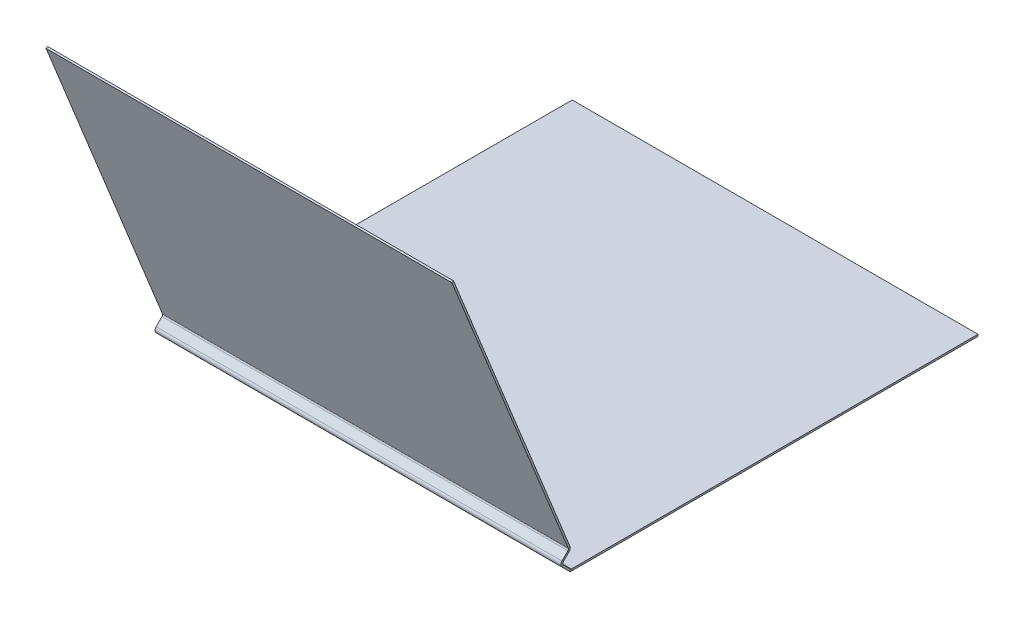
ISO-10303-21;
HEADER;
FILE_DESCRIPTION(('STEP AP214'),'2;1');
FILE_NAME('part.step','',(''),(''),'','','');
FILE_SCHEMA(('AUTOMOTIVE_DESIGN { 1 0 10303 214 1 1 1 1 }'));
ENDSEC;
DATA;
#1=APPLICATION_CONTEXT('core data for automotive mechanical design processes');
#2=APPLICATION_PROTOCOL_DEFINITION('international standard','automotive_design',2000,#1);
#3=PRODUCT_CONTEXT('',#1,'mechanical');
#4=PRODUCT('Part','Part','',(#3));
#5=PRODUCT_RELATED_PRODUCT_CATEGORY('part','',(#4));
#6=PRODUCT_DEFINITION_FORMATION('','',#4);
#7=PRODUCT_DEFINITION_CONTEXT('part definition',#1,'design');
#8=PRODUCT_DEFINITION('design','',#6,#7);
#9=PRODUCT_DEFINITION_SHAPE('','',#8);
#10=(LENGTH_UNIT() NAMED_UNIT(*) SI_UNIT(.MILLI.,.METRE.));
#11=(NAMED_UNIT(*) PLANE_ANGLE_UNIT() SI_UNIT($,.RADIAN.));
#12=(NAMED_UNIT(*) SI_UNIT($,.STERADIAN.) SOLID_ANGLE_UNIT());
#13=UNCERTAINTY_MEASURE_WITH_UNIT(LENGTH_MEASURE(1.E-05),#10,'distance_accuracy_value','');
#14=(GEOMETRIC_REPRESENTATION_CONTEXT(3) GLOBAL_UNCERTAINTY_ASSIGNED_CONTEXT((#13)) GLOBAL_UNIT_ASSIGNED_CONTEXT((#10,
#11,#12)) REPRESENTATION_CONTEXT('',''));
#15=CARTESIAN_POINT('',(0.,0.,0.));
#16=DIRECTION('',(0.,0.,1.));
#17=DIRECTION('',(1.,0.,0.));
#18=AXIS2_PLACEMENT_3D('',#15,#16,#17);
#19=CARTESIAN_POINT('',(0.,32.8730244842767,676.402));
#20=DIRECTION('',(-1.,0.,0.));
#21=DIRECTION('',(0.,-1.,0.));
#22=AXIS2_PLACEMENT_3D('',#19,#20,#21);
#23=PLANE('',#22);
#24=DIRECTION('',(0.,0.707106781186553,-0.707106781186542));
#25=VECTOR('',#24,1.);
#26=CARTESIAN_POINT('',(0.,32.8730244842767,676.402));
#27=LINE('',#26,#25);
#28=CARTESIAN_POINT('',(1.11022302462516E-13,19.3128377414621,689.962186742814));
#29=VERTEX_POINT('',#28);
#30=CARTESIAN_POINT('',(0.,29.0456583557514,680.229366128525));
#31=VERTEX_POINT('',#30);
#32=EDGE_CURVE('E291',#29,#31,#27,.T.);
#33=ORIENTED_EDGE('',*,*,#32,.T.);
#34=DIRECTION('',(0.,-0.707106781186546,-0.707106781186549));
#35=VECTOR('',#34,1.);
#36=CARTESIAN_POINT('',(0.,29.0456583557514,680.229366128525));
#37=LINE('',#36,#35);
#38=CARTESIAN_POINT('',(0.,26.8903968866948,678.074104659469));
#39=VERTEX_POINT('',#38);
#40=EDGE_CURVE('E279',#31,#39,#37,.T.);
#41=ORIENTED_EDGE('',*,*,#40,.T.);
#42=DIRECTION('',(0.,-0.707106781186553,0.707106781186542));
#43=VECTOR('',#42,1.);
#44=CARTESIAN_POINT('',(-2.24457559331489E-12,352.482250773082,352.482250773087));
#45=LINE('',#44,#43);
#46=CARTESIAN_POINT('',(1.11022302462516E-13,17.1575762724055,687.806925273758));
#47=VERTEX_POINT('',#46);
#48=EDGE_CURVE('E295',#47,#39,#45,.F.);
#49=ORIENTED_EDGE('',*,*,#48,.F.);
#50=DIRECTION('',(0.,0.707106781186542,0.707106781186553));
#51=VECTOR('',#50,1.);
#52=CARTESIAN_POINT('',(0.,19.3128377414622,689.962186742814));
#53=LINE('',#52,#51);
#54=EDGE_CURVE('E286',#47,#29,#53,.T.);
#55=ORIENTED_EDGE('',*,*,#54,.T.);
#56=EDGE_LOOP('',(#33,#41,#49,#55));
#57=FACE_BOUND('',#56,.T.);
#58=ADVANCED_FACE('F106',(#57),#23,.T.);
#59=CARTESIAN_POINT('',(0.,354.637512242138,354.637512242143));
#60=DIRECTION('',(0.,0.707106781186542,0.707106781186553));
#61=DIRECTION('',(0.,-0.707106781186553,0.707106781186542));
#62=AXIS2_PLACEMENT_3D('',#59,#60,#61);
#63=PLANE('',#62);
#64=DIRECTION('',(0.,-0.707106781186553,0.707106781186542));
#65=VECTOR('',#64,1.);
#66=CARTESIAN_POINT('',(673.1,17.0677737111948,692.207250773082));
#67=LINE('',#66,#65);
#68=CARTESIAN_POINT('',(673.1,29.0456583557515,680.229366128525));
#69=VERTEX_POINT('',#68);
#70=CARTESIAN_POINT('',(673.1,19.3128377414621,689.962186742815));
#71=VERTEX_POINT('',#70);
#72=EDGE_CURVE('E288',#69,#71,#67,.T.);
#73=ORIENTED_EDGE('',*,*,#72,.F.);
#74=DIRECTION('',(-1.,0.,0.));
#75=VECTOR('',#74,1.);
#76=CARTESIAN_POINT('',(0.,29.0456583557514,680.229366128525));
#77=LINE('',#76,#75);
#78=EDGE_CURVE('E130',#31,#69,#77,.F.);
#79=ORIENTED_EDGE('',*,*,#78,.F.);
#80=ORIENTED_EDGE('',*,*,#32,.F.);
#81=DIRECTION('',(1.,0.,0.));
#82=VECTOR('',#81,1.);
#83=CARTESIAN_POINT('',(-1.56316945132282E-13,19.3128377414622,689.962186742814));
#84=LINE('',#83,#82);
#85=EDGE_CURVE('E298',#29,#71,#84,.T.);
#86=ORIENTED_EDGE('',*,*,#85,.T.);
#87=EDGE_LOOP('',(#73,#79,#80,#86));
#88=FACE_BOUND('',#87,.T.);
#89=ADVANCED_FACE('F428',(#88),#63,.T.);
#90=CARTESIAN_POINT('',(0.,352.482250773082,352.482250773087));
#91=DIRECTION('',(0.,0.707106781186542,0.707106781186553));
#92=DIRECTION('',(0.,-0.707106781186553,0.707106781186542));
#93=AXIS2_PLACEMENT_3D('',#90,#91,#92);
#94=PLANE('',#93);
#95=DIRECTION('',(-1.,0.,0.));
#96=VECTOR('',#95,1.);
#97=CARTESIAN_POINT('',(0.,26.8903968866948,678.074104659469));
#98=LINE('',#97,#96);
#99=CARTESIAN_POINT('',(673.1,26.8903968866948,678.074104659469));
#100=VERTEX_POINT('',#99);
#101=EDGE_CURVE('E229',#39,#100,#98,.F.);
#102=ORIENTED_EDGE('',*,*,#101,.T.);
#103=DIRECTION('',(0.,0.707106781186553,-0.707106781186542));
#104=VECTOR('',#103,1.);
#105=CARTESIAN_POINT('',(673.099999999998,352.482250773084,352.482250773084));
#106=LINE('',#105,#104);
#107=CARTESIAN_POINT('',(673.1,17.1575762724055,687.806925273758));
#108=VERTEX_POINT('',#107);
#109=EDGE_CURVE('E293',#100,#108,#106,.F.);
#110=ORIENTED_EDGE('',*,*,#109,.T.);
#111=DIRECTION('',(-1.,0.,0.));
#112=VECTOR('',#111,1.);
#113=CARTESIAN_POINT('',(0.,17.1575762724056,687.806925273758));
#114=LINE('',#113,#112);
#115=EDGE_CURVE('E304',#47,#108,#114,.F.);
#116=ORIENTED_EDGE('',*,*,#115,.F.);
#117=ORIENTED_EDGE('',*,*,#48,.T.);
#118=EDGE_LOOP('',(#102,#110,#116,#117));
#119=FACE_BOUND('',#118,.T.);
#120=ADVANCED_FACE('F482',(#119),#94,.F.);
#121=CARTESIAN_POINT('',(673.1,14.9125122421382,694.362512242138));
#122=DIRECTION('',(-1.,0.,0.));
#123=DIRECTION('',(0.,0.,1.));
#124=AXIS2_PLACEMENT_3D('',#121,#122,#123);
#125=PLANE('',#124);
#126=DIRECTION('',(0.,-0.707106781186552,0.707106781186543));
#127=VECTOR('',#126,1.);
#128=CARTESIAN_POINT('',(673.1,12.667448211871,687.806925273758));
#129=LINE('',#128,#127);
#130=CARTESIAN_POINT('',(673.1,12.6674482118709,687.806925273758));
#131=VERTEX_POINT('',#130);
#132=CARTESIAN_POINT('',(673.1,10.5121867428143,689.962186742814));
#133=VERTEX_POINT('',#132);
#134=EDGE_CURVE('E315',#131,#133,#129,.T.);
#135=ORIENTED_EDGE('',*,*,#134,.T.);
#136=DIRECTION('',(0.,0.707106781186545,0.70710678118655));
#137=VECTOR('',#136,1.);
#138=CARTESIAN_POINT('',(673.100000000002,-341.880261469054,337.569738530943));
#139=LINE('',#138,#137);
#140=CARTESIAN_POINT('',(673.1,-1.22532549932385,678.224674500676));
#141=VERTEX_POINT('',#140);
#142=EDGE_CURVE('E335',#141,#133,#139,.T.);
#143=ORIENTED_EDGE('',*,*,#142,.F.);
#144=DIRECTION('',(0.,0.70710678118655,-0.707106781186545));
#145=VECTOR('',#144,1.);
#146=CARTESIAN_POINT('',(673.1,0.929935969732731,676.06941303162));
#147=LINE('',#146,#145);
#148=CARTESIAN_POINT('',(673.1,0.929935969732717,676.06941303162));
#149=VERTEX_POINT('',#148);
#150=EDGE_CURVE('E345',#149,#141,#147,.F.);
#151=ORIENTED_EDGE('',*,*,#150,.F.);
#152=DIRECTION('',(0.,-0.707106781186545,-0.70710678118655));
#153=VECTOR('',#152,1.);
#154=CARTESIAN_POINT('',(673.1,17.0677737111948,692.207250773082));
#155=LINE('',#154,#153);
#156=EDGE_CURVE('E339',#149,#131,#155,.F.);
#157=ORIENTED_EDGE('',*,*,#156,.T.);
#158=EDGE_LOOP('',(#135,#143,#151,#157));
#159=FACE_BOUND('',#158,.T.);
#160=ADVANCED_FACE('F502',(#159),#125,.F.);
#161=CARTESIAN_POINT('',(0.,-2.15526146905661,677.294738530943));
#162=DIRECTION('',(1.,0.,0.));
#163=DIRECTION('',(0.,0.,-1.));
#164=AXIS2_PLACEMENT_3D('',#161,#162,#163);
#165=PLANE('',#164);
#166=DIRECTION('',(0.,-0.707106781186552,0.707106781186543));
#167=VECTOR('',#166,1.);
#168=CARTESIAN_POINT('',(1.11022302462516E-13,12.667448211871,687.806925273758));
#169=LINE('',#168,#167);
#170=CARTESIAN_POINT('',(1.11022302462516E-13,12.667448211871,687.806925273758));
#171=VERTEX_POINT('',#170);
#172=CARTESIAN_POINT('',(1.11022302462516E-13,10.5121867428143,689.962186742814));
#173=VERTEX_POINT('',#172);
#174=EDGE_CURVE('E326',#171,#173,#169,.T.);
#175=ORIENTED_EDGE('',*,*,#174,.F.);
#176=DIRECTION('',(0.,0.707106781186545,0.70710678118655));
#177=VECTOR('',#176,1.);
#178=CARTESIAN_POINT('',(0.,0.,675.139477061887));
#179=LINE('',#178,#177);
#180=CARTESIAN_POINT('',(1.11022302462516E-13,0.92993596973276,676.06941303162));
#181=VERTEX_POINT('',#180);
#182=EDGE_CURVE('E337',#171,#181,#179,.F.);
#183=ORIENTED_EDGE('',*,*,#182,.T.);
#184=DIRECTION('',(0.,0.70710678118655,-0.707106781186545));
#185=VECTOR('',#184,1.);
#186=CARTESIAN_POINT('',(0.,-1.22532549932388,678.224674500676));
#187=LINE('',#186,#185);
#188=CARTESIAN_POINT('',(1.10738964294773E-13,-1.22532549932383,678.224674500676));
#189=VERTEX_POINT('',#188);
#190=EDGE_CURVE('E329',#181,#189,#187,.F.);
#191=ORIENTED_EDGE('',*,*,#190,.T.);
#192=DIRECTION('',(0.,-0.707106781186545,-0.70710678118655));
#193=VECTOR('',#192,1.);
#194=CARTESIAN_POINT('',(2.14777796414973E-13,-341.880261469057,337.569738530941));
#195=LINE('',#194,#193);
#196=EDGE_CURVE('E332',#173,#189,#195,.T.);
#197=ORIENTED_EDGE('',*,*,#196,.F.);
#198=EDGE_LOOP('',(#175,#183,#191,#197));
#199=FACE_BOUND('',#198,.T.);
#200=ADVANCED_FACE('F413',(#199),#165,.F.);
#201=CARTESIAN_POINT('',(0.,-341.880261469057,337.569738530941));
#202=DIRECTION('',(0.,0.70710678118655,-0.707106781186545));
#203=DIRECTION('',(0.,0.707106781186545,0.70710678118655));
#204=AXIS2_PLACEMENT_3D('',#201,#202,#203);
#205=PLANE('',#204);
#206=DIRECTION('',(1.,0.,0.));
#207=VECTOR('',#206,1.);
#208=CARTESIAN_POINT('',(673.1,10.5121867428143,689.962186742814));
#209=LINE('',#208,#207);
#210=EDGE_CURVE('E309',#133,#173,#209,.F.);
#211=ORIENTED_EDGE('',*,*,#210,.T.);
#212=ORIENTED_EDGE('',*,*,#196,.T.);
#213=DIRECTION('',(1.,0.,0.));
#214=VECTOR('',#213,1.);
#215=CARTESIAN_POINT('',(0.,-1.22532549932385,678.224674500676));
#216=LINE('',#215,#214);
#217=EDGE_CURVE('E342',#141,#189,#216,.F.);
#218=ORIENTED_EDGE('',*,*,#217,.F.);
#219=ORIENTED_EDGE('',*,*,#142,.T.);
#220=EDGE_LOOP('',(#211,#212,#218,#219));
#221=FACE_BOUND('',#220,.T.);
#222=ADVANCED_FACE('F494',(#221),#205,.F.);
#223=CARTESIAN_POINT('',(0.,-339.725,335.414477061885));
#224=DIRECTION('',(0.,0.70710678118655,-0.707106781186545));
#225=DIRECTION('',(0.,0.707106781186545,0.70710678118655));
#226=AXIS2_PLACEMENT_3D('',#223,#224,#225);
#227=PLANE('',#226);
#228=ORIENTED_EDGE('',*,*,#182,.F.);
#229=DIRECTION('',(1.,0.,0.));
#230=VECTOR('',#229,1.);
#231=CARTESIAN_POINT('',(673.1,12.667448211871,687.806925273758));
#232=LINE('',#231,#230);
#233=EDGE_CURVE('E321',#131,#171,#232,.F.);
#234=ORIENTED_EDGE('',*,*,#233,.F.);
#235=ORIENTED_EDGE('',*,*,#156,.F.);
#236=DIRECTION('',(1.,0.,0.));
#237=VECTOR('',#236,1.);
#238=CARTESIAN_POINT('',(0.,0.929935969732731,676.06941303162));
#239=LINE('',#238,#237);
#240=EDGE_CURVE('E348',#181,#149,#239,.T.);
#241=ORIENTED_EDGE('',*,*,#240,.F.);
#242=EDGE_LOOP('',(#228,#234,#235,#241));
#243=FACE_BOUND('',#242,.T.);
#244=ADVANCED_FACE('F416',(#243),#227,.T.);
#245=CARTESIAN_POINT('',(673.1,-3.048,0.));
#246=DIRECTION('',(1.,0.,0.));
#247=DIRECTION('',(0.,0.,-1.));
#248=AXIS2_PLACEMENT_3D('',#245,#246,#247);
#249=PLANE('',#248);
#250=DIRECTION('',(0.,0.,-1.));
#251=VECTOR('',#250,1.);
#252=CARTESIAN_POINT('',(673.1,0.,0.));
#253=LINE('',#252,#251);
#254=CARTESIAN_POINT('',(673.1,0.,673.824349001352));
#255=VERTEX_POINT('',#254);
#256=CARTESIAN_POINT('',(673.1,0.,0.));
#257=VERTEX_POINT('',#256);
#258=EDGE_CURVE('E386',#255,#257,#253,.T.);
#259=ORIENTED_EDGE('',*,*,#258,.F.);
#260=DIRECTION('',(0.,-1.,0.));
#261=VECTOR('',#260,1.);
#262=CARTESIAN_POINT('',(673.1,0.,673.824349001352));
#263=LINE('',#262,#261);
#264=CARTESIAN_POINT('',(673.1,-3.04799999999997,673.824349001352));
#265=VERTEX_POINT('',#264);
#266=EDGE_CURVE('E358',#255,#265,#263,.T.);
#267=ORIENTED_EDGE('',*,*,#266,.T.);
#268=DIRECTION('',(0.,0.,-1.));
#269=VECTOR('',#268,1.);
#270=CARTESIAN_POINT('',(673.1,-3.048,0.));
#271=LINE('',#270,#269);
#272=CARTESIAN_POINT('',(673.1,-3.048,0.));
#273=VERTEX_POINT('',#272);
#274=EDGE_CURVE('E378',#265,#273,#271,.T.);
#275=ORIENTED_EDGE('',*,*,#274,.T.);
#276=DIRECTION('',(0.,1.,0.));
#277=VECTOR('',#276,1.);
#278=CARTESIAN_POINT('',(673.1,-3.048,0.));
#279=LINE('',#278,#277);
#280=EDGE_CURVE('E115',#273,#257,#279,.T.);
#281=ORIENTED_EDGE('',*,*,#280,.T.);
#282=EDGE_LOOP('',(#259,#267,#275,#281));
#283=FACE_BOUND('',#282,.T.);
#284=ADVANCED_FACE('F394',(#283),#249,.T.);
#285=CARTESIAN_POINT('',(0.,-3.048,0.));
#286=DIRECTION('',(0.,1.,0.));
#287=DIRECTION('',(0.,0.,1.));
#288=AXIS2_PLACEMENT_3D('',#285,#286,#287);
#289=PLANE('',#288);
#290=CARTESIAN_POINT('',(88.9,-3.048,546.824349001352));
#291=DIRECTION('',(0.,-1.,0.));
#292=DIRECTION('',(0.,0.,-1.));
#293=AXIS2_PLACEMENT_3D('',#290,#291,#292);
#294=CIRCLE('',#293,17.4625);
#295=CARTESIAN_POINT('',(88.9,-3.048,529.361849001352));
#296=VERTEX_POINT('',#295);
#297=EDGE_CURVE('E455',#296,#296,#294,.T.);
#298=ORIENTED_EDGE('',*,*,#297,.F.);
#299=EDGE_LOOP('',(#298));
#300=FACE_BOUND('',#299,.T.);
#301=DIRECTION('',(1.,0.,0.));
#302=VECTOR('',#301,1.);
#303=CARTESIAN_POINT('',(673.1,-3.04799999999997,673.824349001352));
#304=LINE('',#303,#302);
#305=CARTESIAN_POINT('',(1.11022302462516E-13,-3.048,673.824349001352));
#306=VERTEX_POINT('',#305);
#307=EDGE_CURVE('E352',#265,#306,#304,.F.);
#308=ORIENTED_EDGE('',*,*,#307,.T.);
#309=DIRECTION('',(0.,0.,1.));
#310=VECTOR('',#309,1.);
#311=CARTESIAN_POINT('',(0.,-3.048,0.));
#312=LINE('',#311,#310);
#313=CARTESIAN_POINT('',(0.,-3.048,0.));
#314=VERTEX_POINT('',#313);
#315=EDGE_CURVE('E375',#314,#306,#312,.T.);
#316=ORIENTED_EDGE('',*,*,#315,.F.);
#317=DIRECTION('',(-1.,0.,0.));
#318=VECTOR('',#317,1.);
#319=CARTESIAN_POINT('',(0.,-3.048,0.));
#320=LINE('',#319,#318);
#321=EDGE_CURVE('E381',#273,#314,#320,.T.);
#322=ORIENTED_EDGE('',*,*,#321,.F.);
#323=ORIENTED_EDGE('',*,*,#274,.F.);
#324=EDGE_LOOP('',(#308,#316,#322,#323));
#325=FACE_BOUND('',#324,.T.);
#326=ADVANCED_FACE('F465',(#300,#325),#289,.F.);
#327=CARTESIAN_POINT('',(0.,0.,0.));
#328=DIRECTION('',(0.,1.,0.));
#329=DIRECTION('',(0.,0.,1.));
#330=AXIS2_PLACEMENT_3D('',#327,#328,#329);
#331=PLANE('',#330);
#332=CARTESIAN_POINT('',(88.9,0.,546.824349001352));
#333=DIRECTION('',(0.,1.,0.));
#334=DIRECTION('',(0.,0.,1.));
#335=AXIS2_PLACEMENT_3D('',#332,#333,#334);
#336=CIRCLE('',#335,17.4625);
#337=CARTESIAN_POINT('',(88.9,0.,564.286849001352));
#338=VERTEX_POINT('',#337);
#339=EDGE_CURVE('E110',#338,#338,#336,.T.);
#340=ORIENTED_EDGE('',*,*,#339,.F.);
#341=EDGE_LOOP('',(#340));
#342=FACE_BOUND('',#341,.T.);
#343=DIRECTION('',(0.,0.,1.));
#344=VECTOR('',#343,1.);
#345=CARTESIAN_POINT('',(0.,0.,0.));
#346=LINE('',#345,#344);
#347=CARTESIAN_POINT('',(0.,0.,0.));
#348=VERTEX_POINT('',#347);
#349=CARTESIAN_POINT('',(1.11022302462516E-13,0.,673.824349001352));
#350=VERTEX_POINT('',#349);
#351=EDGE_CURVE('E372',#348,#350,#346,.T.);
#352=ORIENTED_EDGE('',*,*,#351,.T.);
#353=DIRECTION('',(1.,0.,0.));
#354=VECTOR('',#353,1.);
#355=CARTESIAN_POINT('',(673.1,0.,673.824349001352));
#356=LINE('',#355,#354);
#357=EDGE_CURVE('E364',#255,#350,#356,.F.);
#358=ORIENTED_EDGE('',*,*,#357,.F.);
#359=ORIENTED_EDGE('',*,*,#258,.T.);
#360=DIRECTION('',(-1.,0.,0.));
#361=VECTOR('',#360,1.);
#362=CARTESIAN_POINT('',(0.,0.,0.));
#363=LINE('',#362,#361);
#364=EDGE_CURVE('E379',#257,#348,#363,.T.);
#365=ORIENTED_EDGE('',*,*,#364,.T.);
#366=EDGE_LOOP('',(#352,#358,#359,#365));
#367=FACE_BOUND('',#366,.T.);
#368=ADVANCED_FACE('F401',(#342,#367),#331,.T.);
#369=CARTESIAN_POINT('',(0.,-3.048,0.));
#370=DIRECTION('',(-1.,0.,0.));
#371=DIRECTION('',(0.,0.,1.));
#372=AXIS2_PLACEMENT_3D('',#369,#370,#371);
#373=PLANE('',#372);
#374=DIRECTION('',(0.,-1.,0.));
#375=VECTOR('',#374,1.);
#376=CARTESIAN_POINT('',(1.11022302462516E-13,0.,673.824349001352));
#377=LINE('',#376,#375);
#378=EDGE_CURVE('E369',#350,#306,#377,.T.);
#379=ORIENTED_EDGE('',*,*,#378,.F.);
#380=ORIENTED_EDGE('',*,*,#351,.F.);
#381=DIRECTION('',(0.,1.,0.));
#382=VECTOR('',#381,1.);
#383=CARTESIAN_POINT('',(0.,-3.048,0.));
#384=LINE('',#383,#382);
#385=EDGE_CURVE('E13',#314,#348,#384,.T.);
#386=ORIENTED_EDGE('',*,*,#385,.F.);
#387=ORIENTED_EDGE('',*,*,#315,.T.);
#388=EDGE_LOOP('',(#379,#380,#386,#387));
#389=FACE_BOUND('',#388,.T.);
#390=ADVANCED_FACE('F108',(#389),#373,.T.);
#391=CARTESIAN_POINT('',(0.,-3.048,0.));
#392=DIRECTION('',(0.,0.,-1.));
#393=DIRECTION('',(-1.,0.,0.));
#394=AXIS2_PLACEMENT_3D('',#391,#392,#393);
#395=PLANE('',#394);
#396=ORIENTED_EDGE('',*,*,#364,.F.);
#397=ORIENTED_EDGE('',*,*,#280,.F.);
#398=ORIENTED_EDGE('',*,*,#321,.T.);
#399=ORIENTED_EDGE('',*,*,#385,.T.);
#400=EDGE_LOOP('',(#396,#397,#398,#399));
#401=FACE_BOUND('',#400,.T.);
#402=ADVANCED_FACE('F398',(#401),#395,.T.);
#403=CARTESIAN_POINT('',(1.11022302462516E-13,3.17500000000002,673.824349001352));
#404=DIRECTION('',(-1.,0.,0.));
#405=DIRECTION('',(0.,-1.,0.));
#406=AXIS2_PLACEMENT_3D('',#403,#404,#405);
#407=PLANE('',#406);
#408=ORIENTED_EDGE('',*,*,#190,.F.);
#409=CARTESIAN_POINT('',(1.11022302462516E-13,3.17500000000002,673.824349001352));
#410=DIRECTION('',(1.,0.,0.));
#411=DIRECTION('',(0.,1.,0.));
#412=AXIS2_PLACEMENT_3D('',#409,#410,#411);
#413=CIRCLE('',#412,3.17499999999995);
#414=EDGE_CURVE('E361',#350,#181,#413,.F.);
#415=ORIENTED_EDGE('',*,*,#414,.F.);
#416=ORIENTED_EDGE('',*,*,#378,.T.);
#417=CARTESIAN_POINT('',(1.11022302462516E-13,3.17500000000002,673.824349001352));
#418=DIRECTION('',(1.,0.,0.));
#419=DIRECTION('',(0.,1.,0.));
#420=AXIS2_PLACEMENT_3D('',#417,#418,#419);
#421=CIRCLE('',#420,6.22299999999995);
#422=EDGE_CURVE('E354',#306,#189,#421,.F.);
#423=ORIENTED_EDGE('',*,*,#422,.T.);
#424=EDGE_LOOP('',(#408,#415,#416,#423));
#425=FACE_BOUND('',#424,.T.);
#426=ADVANCED_FACE('F409',(#425),#407,.T.);
#427=CARTESIAN_POINT('',(673.1,3.17499999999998,673.824349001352));
#428=DIRECTION('',(-1.,0.,0.));
#429=DIRECTION('',(0.,-1.,0.));
#430=AXIS2_PLACEMENT_3D('',#427,#428,#429);
#431=PLANE('',#430);
#432=CARTESIAN_POINT('',(673.1,3.17499999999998,673.824349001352));
#433=DIRECTION('',(1.,0.,0.));
#434=DIRECTION('',(0.,1.,0.));
#435=AXIS2_PLACEMENT_3D('',#432,#433,#434);
#436=CIRCLE('',#435,3.17499999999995);
#437=EDGE_CURVE('E334',#149,#255,#436,.T.);
#438=ORIENTED_EDGE('',*,*,#437,.F.);
#439=ORIENTED_EDGE('',*,*,#150,.T.);
#440=CARTESIAN_POINT('',(673.1,3.17499999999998,673.824349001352));
#441=DIRECTION('',(1.,0.,0.));
#442=DIRECTION('',(0.,1.,0.));
#443=AXIS2_PLACEMENT_3D('',#440,#441,#442);
#444=CIRCLE('',#443,6.22299999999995);
#445=EDGE_CURVE('E355',#141,#265,#444,.T.);
#446=ORIENTED_EDGE('',*,*,#445,.T.);
#447=ORIENTED_EDGE('',*,*,#266,.F.);
#448=EDGE_LOOP('',(#438,#439,#446,#447));
#449=FACE_BOUND('',#448,.T.);
#450=ADVANCED_FACE('F509',(#449),#431,.F.);
#451=CARTESIAN_POINT('',(673.1,3.17499999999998,673.824349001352));
#452=DIRECTION('',(1.,0.,0.));
#453=DIRECTION('',(0.,-0.70710678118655,0.707106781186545));
#454=AXIS2_PLACEMENT_3D('',#451,#452,#453);
#455=CYLINDRICAL_SURFACE('',#454,6.22299999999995);
#456=ORIENTED_EDGE('',*,*,#307,.F.);
#457=ORIENTED_EDGE('',*,*,#445,.F.);
#458=ORIENTED_EDGE('',*,*,#217,.T.);
#459=ORIENTED_EDGE('',*,*,#422,.F.);
#460=EDGE_LOOP('',(#456,#457,#458,#459));
#461=FACE_BOUND('',#460,.T.);
#462=ADVANCED_FACE('F506',(#461),#455,.T.);
#463=CARTESIAN_POINT('',(673.1,3.17499999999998,673.824349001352));
#464=DIRECTION('',(1.,0.,0.));
#465=DIRECTION('',(0.,-0.70710678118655,0.707106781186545));
#466=AXIS2_PLACEMENT_3D('',#463,#464,#465);
#467=CYLINDRICAL_SURFACE('',#466,3.17499999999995);
#468=ORIENTED_EDGE('',*,*,#357,.T.);
#469=ORIENTED_EDGE('',*,*,#414,.T.);
#470=ORIENTED_EDGE('',*,*,#240,.T.);
#471=ORIENTED_EDGE('',*,*,#437,.T.);
#472=EDGE_LOOP('',(#468,#469,#470,#471));
#473=FACE_BOUND('',#472,.T.);
#474=ADVANCED_FACE('F404',(#473),#467,.F.);
#475=CARTESIAN_POINT('',(1.11022302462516E-13,14.9125122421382,685.561861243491));
#476=DIRECTION('',(-1.,0.,0.));
#477=DIRECTION('',(0.,0.,1.));
#478=AXIS2_PLACEMENT_3D('',#475,#476,#477);
#479=PLANE('',#478);
#480=ORIENTED_EDGE('',*,*,#54,.F.);
#481=CARTESIAN_POINT('',(1.11022302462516E-13,14.9125122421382,685.561861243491));
#482=DIRECTION('',(1.,0.,0.));
#483=DIRECTION('',(0.,0.,-1.));
#484=AXIS2_PLACEMENT_3D('',#481,#482,#483);
#485=CIRCLE('',#484,3.17499999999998);
#486=EDGE_CURVE('E318',#171,#47,#485,.F.);
#487=ORIENTED_EDGE('',*,*,#486,.F.);
#488=ORIENTED_EDGE('',*,*,#174,.T.);
#489=CARTESIAN_POINT('',(1.11022302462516E-13,14.9125122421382,685.561861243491));
#490=DIRECTION('',(1.,0.,0.));
#491=DIRECTION('',(0.,0.,-1.));
#492=AXIS2_PLACEMENT_3D('',#489,#490,#491);
#493=CIRCLE('',#492,6.22299999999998);
#494=EDGE_CURVE('E311',#173,#29,#493,.F.);
#495=ORIENTED_EDGE('',*,*,#494,.T.);
#496=EDGE_LOOP('',(#480,#487,#488,#495));
#497=FACE_BOUND('',#496,.T.);
#498=ADVANCED_FACE('F424',(#497),#479,.T.);
#499=CARTESIAN_POINT('',(673.1,14.9125122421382,685.561861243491));
#500=DIRECTION('',(-1.,0.,0.));
#501=DIRECTION('',(0.,0.,1.));
#502=AXIS2_PLACEMENT_3D('',#499,#500,#501);
#503=PLANE('',#502);
#504=CARTESIAN_POINT('',(673.1,14.9125122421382,685.561861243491));
#505=DIRECTION('',(1.,0.,0.));
#506=DIRECTION('',(0.,0.,-1.));
#507=AXIS2_PLACEMENT_3D('',#504,#505,#506);
#508=CIRCLE('',#507,3.17499999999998);
#509=EDGE_CURVE('E290',#108,#131,#508,.T.);
#510=ORIENTED_EDGE('',*,*,#509,.F.);
#511=DIRECTION('',(0.,0.707106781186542,0.707106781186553));
#512=VECTOR('',#511,1.);
#513=CARTESIAN_POINT('',(673.1,17.1575762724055,687.806925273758));
#514=LINE('',#513,#512);
#515=EDGE_CURVE('E301',#108,#71,#514,.T.);
#516=ORIENTED_EDGE('',*,*,#515,.T.);
#517=CARTESIAN_POINT('',(673.1,14.9125122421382,685.561861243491));
#518=DIRECTION('',(1.,0.,0.));
#519=DIRECTION('',(0.,0.,-1.));
#520=AXIS2_PLACEMENT_3D('',#517,#518,#519);
#521=CIRCLE('',#520,6.22299999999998);
#522=EDGE_CURVE('E312',#71,#133,#521,.T.);
#523=ORIENTED_EDGE('',*,*,#522,.T.);
#524=ORIENTED_EDGE('',*,*,#134,.F.);
#525=EDGE_LOOP('',(#510,#516,#523,#524));
#526=FACE_BOUND('',#525,.T.);
#527=ADVANCED_FACE('F436',(#526),#503,.F.);
#528=CARTESIAN_POINT('',(673.1,14.9125122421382,685.561861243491));
#529=DIRECTION('',(1.,0.,0.));
#530=DIRECTION('',(0.,0.707106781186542,0.707106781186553));
#531=AXIS2_PLACEMENT_3D('',#528,#529,#530);
#532=CYLINDRICAL_SURFACE('',#531,6.22299999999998);
#533=ORIENTED_EDGE('',*,*,#210,.F.);
#534=ORIENTED_EDGE('',*,*,#522,.F.);
#535=ORIENTED_EDGE('',*,*,#85,.F.);
#536=ORIENTED_EDGE('',*,*,#494,.F.);
#537=EDGE_LOOP('',(#533,#534,#535,#536));
#538=FACE_BOUND('',#537,.T.);
#539=ADVANCED_FACE('F432',(#538),#532,.T.);
#540=CARTESIAN_POINT('',(673.1,14.9125122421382,685.561861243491));
#541=DIRECTION('',(1.,0.,0.));
#542=DIRECTION('',(0.,0.707106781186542,0.707106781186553));
#543=AXIS2_PLACEMENT_3D('',#540,#541,#542);
#544=CYLINDRICAL_SURFACE('',#543,3.17499999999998);
#545=ORIENTED_EDGE('',*,*,#233,.T.);
#546=ORIENTED_EDGE('',*,*,#486,.T.);
#547=ORIENTED_EDGE('',*,*,#115,.T.);
#548=ORIENTED_EDGE('',*,*,#509,.T.);
#549=EDGE_LOOP('',(#545,#546,#547,#548));
#550=FACE_BOUND('',#549,.T.);
#551=ADVANCED_FACE('F420',(#550),#544,.F.);
#552=CARTESIAN_POINT('',(673.1,17.0677737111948,692.207250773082));
#553=DIRECTION('',(1.,0.,0.));
#554=DIRECTION('',(0.,1.,0.));
#555=AXIS2_PLACEMENT_3D('',#552,#553,#554);
#556=PLANE('',#555);
#557=DIRECTION('',(0.,-0.707106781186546,-0.707106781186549));
#558=VECTOR('',#557,1.);
#559=CARTESIAN_POINT('',(673.1,29.0456583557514,680.229366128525));
#560=LINE('',#559,#558);
#561=EDGE_CURVE('E123',#69,#100,#560,.T.);
#562=ORIENTED_EDGE('',*,*,#561,.F.);
#563=ORIENTED_EDGE('',*,*,#72,.T.);
#564=ORIENTED_EDGE('',*,*,#515,.F.);
#565=ORIENTED_EDGE('',*,*,#109,.F.);
#566=EDGE_LOOP('',(#562,#563,#564,#565));
#567=FACE_BOUND('',#566,.T.);
#568=ADVANCED_FACE('F437',(#567),#556,.T.);
#569=CARTESIAN_POINT('',(673.1,31.2907223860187,682.474430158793));
#570=DIRECTION('',(1.,0.,0.));
#571=DIRECTION('',(0.,0.,-1.));
#572=AXIS2_PLACEMENT_3D('',#569,#570,#571);
#573=PLANE('',#572);
#574=DIRECTION('',(0.,0.374606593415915,-0.927183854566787));
#575=VECTOR('',#574,1.);
#576=CARTESIAN_POINT('',(673.1,33.6218992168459,676.704565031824));
#577=LINE('',#576,#575);
#578=CARTESIAN_POINT('',(673.1,32.4800983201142,679.530621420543));
#579=VERTEX_POINT('',#578);
#580=CARTESIAN_POINT('',(673.1,33.6218992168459,676.704565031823));
#581=VERTEX_POINT('',#580);
#582=EDGE_CURVE('E274',#579,#581,#577,.T.);
#583=ORIENTED_EDGE('',*,*,#582,.F.);
#584=CARTESIAN_POINT('',(673.1,31.2907223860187,682.474430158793));
#585=DIRECTION('',(-1.,0.,0.));
#586=DIRECTION('',(0.,0.,1.));
#587=AXIS2_PLACEMENT_3D('',#584,#585,#586);
#588=CIRCLE('',#587,3.17499999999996);
#589=EDGE_CURVE('E232',#69,#579,#588,.F.);
#590=ORIENTED_EDGE('',*,*,#589,.F.);
#591=ORIENTED_EDGE('',*,*,#561,.T.);
#592=CARTESIAN_POINT('',(673.1,31.2907223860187,682.474430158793));
#593=DIRECTION('',(-1.,0.,0.));
#594=DIRECTION('',(0.,0.,1.));
#595=AXIS2_PLACEMENT_3D('',#592,#593,#594);
#596=CIRCLE('',#595,6.22299999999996);
#597=EDGE_CURVE('E278',#100,#581,#596,.F.);
#598=ORIENTED_EDGE('',*,*,#597,.T.);
#599=EDGE_LOOP('',(#583,#590,#591,#598));
#600=FACE_BOUND('',#599,.T.);
#601=ADVANCED_FACE('F441',(#600),#573,.T.);
#602=CARTESIAN_POINT('',(0.,31.2907223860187,682.474430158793));
#603=DIRECTION('',(1.,0.,0.));
#604=DIRECTION('',(0.,0.,-1.));
#605=AXIS2_PLACEMENT_3D('',#602,#603,#604);
#606=PLANE('',#605);
#607=CARTESIAN_POINT('',(0.,31.2907223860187,682.474430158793));
#608=DIRECTION('',(-1.,0.,0.));
#609=DIRECTION('',(0.,0.,1.));
#610=AXIS2_PLACEMENT_3D('',#607,#608,#609);
#611=CIRCLE('',#610,3.17499999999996);
#612=CARTESIAN_POINT('',(0.,32.4800983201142,679.530621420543));
#613=VERTEX_POINT('',#612);
#614=EDGE_CURVE('E239',#613,#31,#611,.T.);
#615=ORIENTED_EDGE('',*,*,#614,.F.);
#616=DIRECTION('',(0.,0.374606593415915,-0.927183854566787));
#617=VECTOR('',#616,1.);
#618=CARTESIAN_POINT('',(0.,32.4800983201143,679.530621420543));
#619=LINE('',#618,#617);
#620=CARTESIAN_POINT('',(0.,33.6218992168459,676.704565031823));
#621=VERTEX_POINT('',#620);
#622=EDGE_CURVE('E236',#613,#621,#619,.T.);
#623=ORIENTED_EDGE('',*,*,#622,.T.);
#624=CARTESIAN_POINT('',(0.,31.2907223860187,682.474430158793));
#625=DIRECTION('',(-1.,0.,0.));
#626=DIRECTION('',(0.,0.,1.));
#627=AXIS2_PLACEMENT_3D('',#624,#625,#626);
#628=CIRCLE('',#627,6.22299999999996);
#629=EDGE_CURVE('E222',#621,#39,#628,.T.);
#630=ORIENTED_EDGE('',*,*,#629,.T.);
#631=ORIENTED_EDGE('',*,*,#40,.F.);
#632=EDGE_LOOP('',(#615,#623,#630,#631));
#633=FACE_BOUND('',#632,.T.);
#634=ADVANCED_FACE('F237',(#633),#606,.F.);
#635=CARTESIAN_POINT('',(0.,31.2907223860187,682.474430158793));
#636=DIRECTION('',(-1.,0.,0.));
#637=DIRECTION('',(0.,0.374606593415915,-0.927183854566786));
#638=AXIS2_PLACEMENT_3D('',#635,#636,#637);
#639=CYLINDRICAL_SURFACE('',#638,6.22299999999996);
#640=ORIENTED_EDGE('',*,*,#101,.F.);
#641=ORIENTED_EDGE('',*,*,#629,.F.);
#642=DIRECTION('',(-1.,0.,0.));
#643=VECTOR('',#642,1.);
#644=CARTESIAN_POINT('',(0.,33.6218992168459,676.704565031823));
#645=LINE('',#644,#643);
#646=EDGE_CURVE('E227',#581,#621,#645,.T.);
#647=ORIENTED_EDGE('',*,*,#646,.F.);
#648=ORIENTED_EDGE('',*,*,#597,.F.);
#649=EDGE_LOOP('',(#640,#641,#647,#648));
#650=FACE_BOUND('',#649,.T.);
#651=ADVANCED_FACE('F224',(#650),#639,.T.);
#652=CARTESIAN_POINT('',(0.,31.2907223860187,682.474430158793));
#653=DIRECTION('',(-1.,0.,0.));
#654=DIRECTION('',(0.,0.374606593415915,-0.927183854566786));
#655=AXIS2_PLACEMENT_3D('',#652,#653,#654);
#656=CYLINDRICAL_SURFACE('',#655,3.17499999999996);
#657=ORIENTED_EDGE('',*,*,#78,.T.);
#658=ORIENTED_EDGE('',*,*,#589,.T.);
#659=DIRECTION('',(1.,0.,0.));
#660=VECTOR('',#659,1.);
#661=CARTESIAN_POINT('',(673.1,32.4800983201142,679.530621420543));
#662=LINE('',#661,#660);
#663=EDGE_CURVE('E244',#579,#613,#662,.F.);
#664=ORIENTED_EDGE('',*,*,#663,.T.);
#665=ORIENTED_EDGE('',*,*,#614,.T.);
#666=EDGE_LOOP('',(#657,#658,#664,#665));
#667=FACE_BOUND('',#666,.T.);
#668=ADVANCED_FACE('F444',(#667),#656,.F.);
#669=CARTESIAN_POINT('',(0.,31.6734347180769,675.917334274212));
#670=DIRECTION('',(-1.,0.,0.));
#671=DIRECTION('',(0.,-1.,0.));
#672=AXIS2_PLACEMENT_3D('',#669,#670,#671);
#673=PLANE('',#672);
#674=DIRECTION('',(0.,-0.927183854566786,-0.374606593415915));
#675=VECTOR('',#674,1.);
#676=CARTESIAN_POINT('',(0.,31.6734347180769,675.917334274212));
#677=LINE('',#676,#675);
#678=CARTESIAN_POINT('',(0.,511.645523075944,869.838645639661));
#679=VERTEX_POINT('',#678);
#680=EDGE_CURVE('E251',#679,#621,#677,.T.);
#681=ORIENTED_EDGE('',*,*,#680,.T.);
#682=ORIENTED_EDGE('',*,*,#622,.F.);
#683=DIRECTION('',(0.,0.927183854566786,0.374606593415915));
#684=VECTOR('',#683,1.);
#685=CARTESIAN_POINT('',(0.,-232.662471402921,572.406069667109));
#686=LINE('',#685,#684);
#687=CARTESIAN_POINT('',(0.,510.503722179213,872.664702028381));
#688=VERTEX_POINT('',#687);
#689=EDGE_CURVE('E267',#688,#613,#686,.F.);
#690=ORIENTED_EDGE('',*,*,#689,.F.);
#691=DIRECTION('',(0.,-0.374606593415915,0.927183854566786));
#692=VECTOR('',#691,1.);
#693=CARTESIAN_POINT('',(0.,511.645523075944,869.838645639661));
#694=LINE('',#693,#692);
#695=EDGE_CURVE('E256',#679,#688,#694,.T.);
#696=ORIENTED_EDGE('',*,*,#695,.F.);
#697=EDGE_LOOP('',(#681,#682,#690,#696));
#698=FACE_BOUND('',#697,.T.);
#699=ADVANCED_FACE('F255',(#698),#673,.T.);
#700=CARTESIAN_POINT('',(673.1,511.645523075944,869.838645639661));
#701=DIRECTION('',(1.,0.,0.));
#702=DIRECTION('',(0.,0.,-1.));
#703=AXIS2_PLACEMENT_3D('',#700,#701,#702);
#704=PLANE('',#703);
#705=DIRECTION('',(0.,-0.927183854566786,-0.374606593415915));
#706=VECTOR('',#705,1.);
#707=CARTESIAN_POINT('',(673.1,-232.662471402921,572.406069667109));
#708=LINE('',#707,#706);
#709=CARTESIAN_POINT('',(673.1,510.503722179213,872.664702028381));
#710=VERTEX_POINT('',#709);
#711=EDGE_CURVE('E253',#579,#710,#708,.F.);
#712=ORIENTED_EDGE('',*,*,#711,.F.);
#713=ORIENTED_EDGE('',*,*,#582,.T.);
#714=DIRECTION('',(0.,0.927183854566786,0.374606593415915));
#715=VECTOR('',#714,1.);
#716=CARTESIAN_POINT('',(673.1,511.645523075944,869.838645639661));
#717=LINE('',#716,#715);
#718=CARTESIAN_POINT('',(673.1,511.645523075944,869.838645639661));
#719=VERTEX_POINT('',#718);
#720=EDGE_CURVE('E252',#581,#719,#717,.T.);
#721=ORIENTED_EDGE('',*,*,#720,.T.);
#722=DIRECTION('',(0.,-0.374606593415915,0.927183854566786));
#723=VECTOR('',#722,1.);
#724=CARTESIAN_POINT('',(673.1,511.645523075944,869.838645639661));
#725=LINE('',#724,#723);
#726=EDGE_CURVE('E258',#719,#710,#725,.T.);
#727=ORIENTED_EDGE('',*,*,#726,.T.);
#728=EDGE_LOOP('',(#712,#713,#721,#727));
#729=FACE_BOUND('',#728,.T.);
#730=ADVANCED_FACE('F449',(#729),#704,.T.);
#731=CARTESIAN_POINT('',(-1.03494390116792E-13,-231.52067050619,569.580013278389));
#732=DIRECTION('',(0.,0.374606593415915,-0.927183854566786));
#733=DIRECTION('',(0.,0.927183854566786,0.374606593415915));
#734=AXIS2_PLACEMENT_3D('',#731,#732,#733);
#735=PLANE('',#734);
#736=ORIENTED_EDGE('',*,*,#720,.F.);
#737=ORIENTED_EDGE('',*,*,#646,.T.);
#738=ORIENTED_EDGE('',*,*,#680,.F.);
#739=DIRECTION('',(-1.,0.,0.));
#740=VECTOR('',#739,1.);
#741=CARTESIAN_POINT('',(0.,511.645523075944,869.838645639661));
#742=LINE('',#741,#740);
#743=EDGE_CURVE('E259',#719,#679,#742,.T.);
#744=ORIENTED_EDGE('',*,*,#743,.F.);
#745=EDGE_LOOP('',(#736,#737,#738,#744));
#746=FACE_BOUND('',#745,.T.);
#747=ADVANCED_FACE('F249',(#746),#735,.T.);
#748=CARTESIAN_POINT('',(-1.04007607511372E-13,-232.662471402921,572.406069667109));
#749=DIRECTION('',(0.,0.374606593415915,-0.927183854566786));
#750=DIRECTION('',(0.,0.927183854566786,0.374606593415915));
#751=AXIS2_PLACEMENT_3D('',#748,#749,#750);
#752=PLANE('',#751);
#753=ORIENTED_EDGE('',*,*,#663,.F.);
#754=ORIENTED_EDGE('',*,*,#711,.T.);
#755=DIRECTION('',(1.,0.,0.));
#756=VECTOR('',#755,1.);
#757=CARTESIAN_POINT('',(-1.04007607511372E-13,510.503722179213,872.664702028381));
#758=LINE('',#757,#756);
#759=EDGE_CURVE('E269',#710,#688,#758,.F.);
#760=ORIENTED_EDGE('',*,*,#759,.T.);
#761=ORIENTED_EDGE('',*,*,#689,.T.);
#762=EDGE_LOOP('',(#753,#754,#760,#761));
#763=FACE_BOUND('',#762,.T.);
#764=ADVANCED_FACE('F447',(#763),#752,.F.);
#765=CARTESIAN_POINT('',(0.,511.645523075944,869.838645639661));
#766=DIRECTION('',(0.,0.927183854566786,0.374606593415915));
#767=DIRECTION('',(0.,-0.374606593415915,0.927183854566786));
#768=AXIS2_PLACEMENT_3D('',#765,#766,#767);
#769=PLANE('',#768);
#770=ORIENTED_EDGE('',*,*,#759,.F.);
#771=ORIENTED_EDGE('',*,*,#726,.F.);
#772=ORIENTED_EDGE('',*,*,#743,.T.);
#773=ORIENTED_EDGE('',*,*,#695,.T.);
#774=EDGE_LOOP('',(#770,#771,#772,#773));
#775=FACE_BOUND('',#774,.T.);
#776=ADVANCED_FACE('F453',(#775),#769,.T.);
#777=CARTESIAN_POINT('',(88.9,511.645523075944,546.824349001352));
#778=DIRECTION('',(0.,-1.,0.));
#779=DIRECTION('',(0.,0.,-1.));
#780=AXIS2_PLACEMENT_3D('',#777,#778,#779);
#781=CYLINDRICAL_SURFACE('',#780,17.4625);
#782=ORIENTED_EDGE('',*,*,#339,.T.);
#783=EDGE_LOOP('',(#782));
#784=FACE_BOUND('',#783,.T.);
#785=ORIENTED_EDGE('',*,*,#297,.T.);
#786=EDGE_LOOP('',(#785));
#787=FACE_BOUND('',#786,.T.);
#788=ADVANCED_FACE('F462',(#784,#787),#781,.F.);
#789=CLOSED_SHELL('',(#58,#89,#120,#160,#200,#222,#244,#284,#326,#368,#390,#402,#426,#450,#462,
#474,#498,#527,#539,#551,#568,#601,#634,#651,#668,#699,#730,#747,#764,#776,#788));
#790=MANIFOLD_SOLID_BREP('B2',#789);
#791=ADVANCED_BREP_SHAPE_REPRESENTATION('',(#18,#790),#14);
#792=SHAPE_DEFINITION_REPRESENTATION(#9,#791);
ENDSEC;
END-ISO-10303-21;
